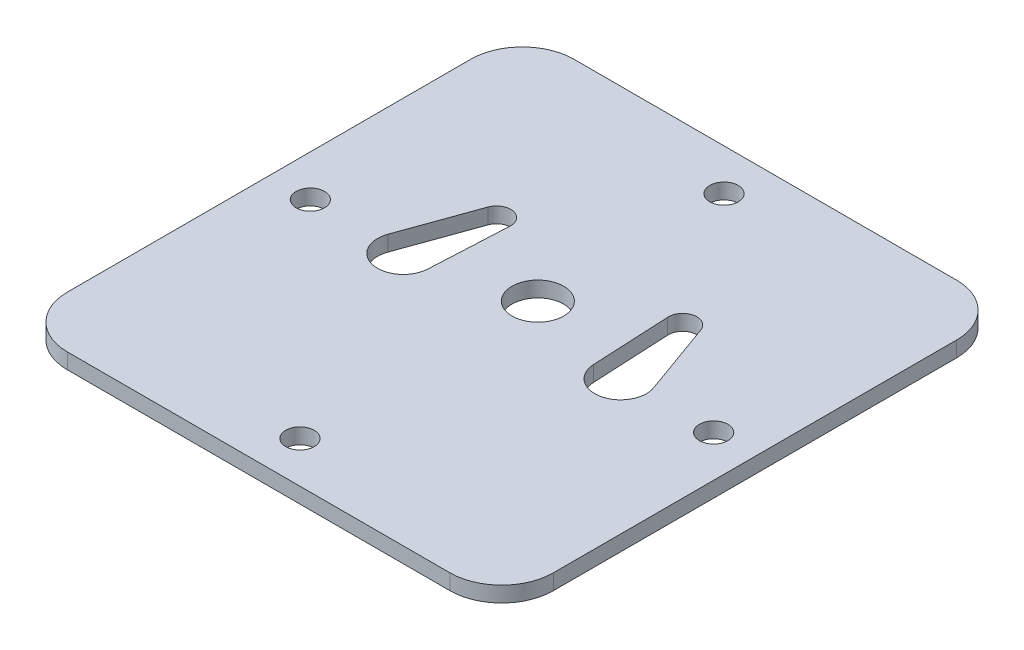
from build123d import *

# Parameters (mm, degrees)
SKETCH1_R      = 2.75
SKETCH1_R_2    = 5
EXTRUDE1_DEPTH = 3


with BuildPart() as part:
    # Sketch1 → Extrude1 (new body)
    with BuildSketch(Plane(origin=(0, 0, 0), x_dir=(1, 0, 0), z_dir=(0, 1, 0))):
        with BuildLine():
            Line((10, 0), (84, 0))
            ThreePointArc((84, 0), (91.071067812, 2.928932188), (94, 10))
            Line((94, 10), (94, 88))
            ThreePointArc((94, 88), (91.071067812, 95.071067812), (84, 98))
            Line((84, 98), (10, 98))
            ThreePointArc((10, 98), (2.928932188, 95.071067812), (0, 88))
            Line((0, 88), (0, 10))
            ThreePointArc((0, 10), (2.928932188, 2.928932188), (10, 0))
        make_face()
        with Locations(Location((47, 90, 0), (0, 0, 270))):
            Circle(SKETCH1_R, mode=Mode.SUBTRACT)
        with Locations(Location((86, 49, 0), (0, 0, 270))):
            Circle(SKETCH1_R, mode=Mode.SUBTRACT)
        with Locations(Location((47, 8, 0), (0, 0, 270))):
            Circle(SKETCH1_R, mode=Mode.SUBTRACT)
        with Locations(Location((8, 49, 0), (0, 0, 270))):
            Circle(SKETCH1_R, mode=Mode.SUBTRACT)
        with Locations(Location((47, 54, 0), (0, 0, 270))):
            Circle(SKETCH1_R_2, mode=Mode.SUBTRACT)
        with BuildLine():
            Line((26.412059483, 64.930088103), (21.294653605, 50.691069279))
            ThreePointArc((21.294653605, 50.691069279), (25.019419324, 44.097096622), (30.993807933, 48.751238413))
            Line((30.993807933, 48.751238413), (31.746594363, 63.863181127))
            ThreePointArc((31.746594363, 63.863181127), (29.539319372, 66.696596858), (26.412059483, 64.930088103))
        make_face(mode=Mode.SUBTRACT)
        with BuildLine():
            Line((62.253405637, 63.863181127), (63.006192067, 48.751238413))
            ThreePointArc((63.006192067, 48.751238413), (68.980580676, 44.097096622), (72.705346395, 50.691069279))
            Line((72.705346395, 50.691069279), (67.587940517, 64.930088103))
            ThreePointArc((67.587940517, 64.930088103), (64.460680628, 66.696596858), (62.253405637, 63.863181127))
        make_face(mode=Mode.SUBTRACT)
    extrude(amount=EXTRUDE1_DEPTH)


solid = part.part
